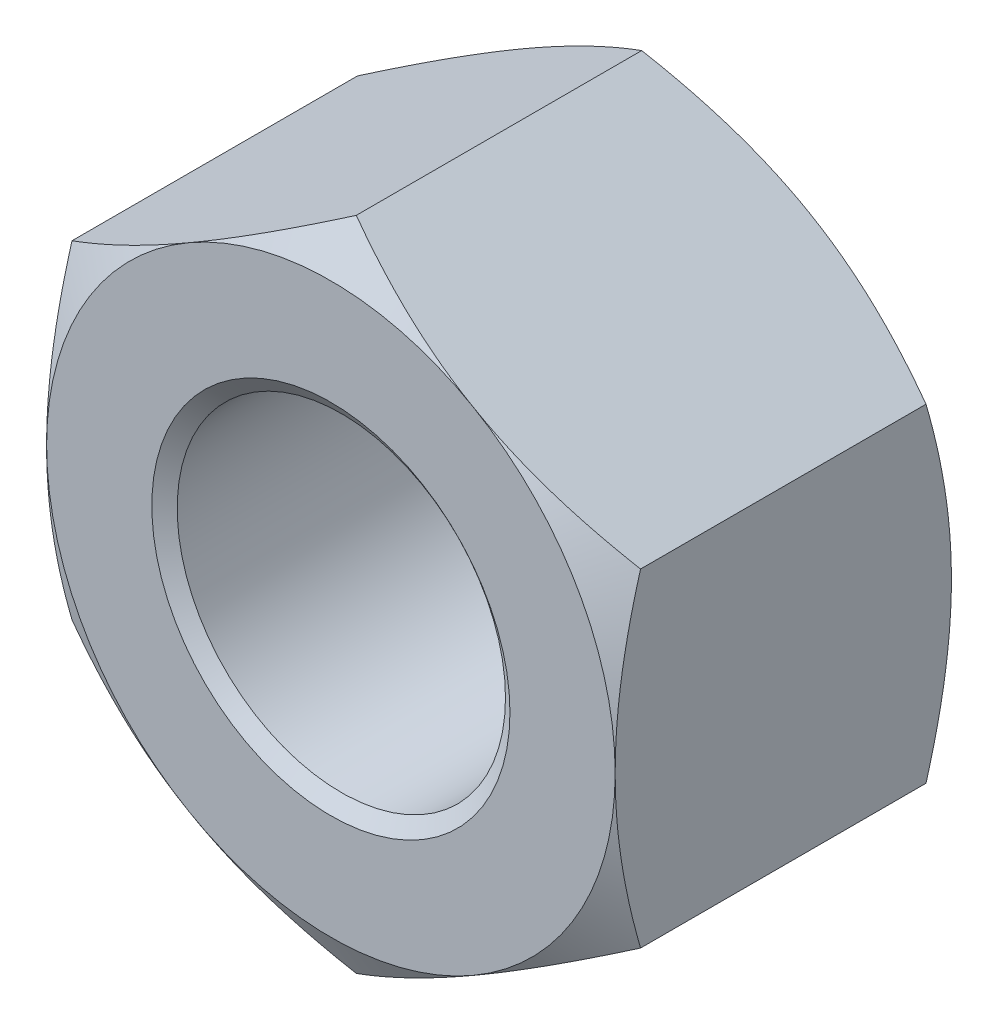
ISO-10303-21;
HEADER;
FILE_DESCRIPTION(('STEP AP214'),'2;1');
FILE_NAME('part.step','',(''),(''),'','','');
FILE_SCHEMA(('AUTOMOTIVE_DESIGN { 1 0 10303 214 1 1 1 1 }'));
ENDSEC;
DATA;
#1=APPLICATION_CONTEXT('core data for automotive mechanical design processes');
#2=APPLICATION_PROTOCOL_DEFINITION('international standard','automotive_design',2000,#1);
#3=PRODUCT_CONTEXT('',#1,'mechanical');
#4=PRODUCT('Part','Part','',(#3));
#5=PRODUCT_RELATED_PRODUCT_CATEGORY('part','',(#4));
#6=PRODUCT_DEFINITION_FORMATION('','',#4);
#7=PRODUCT_DEFINITION_CONTEXT('part definition',#1,'design');
#8=PRODUCT_DEFINITION('design','',#6,#7);
#9=PRODUCT_DEFINITION_SHAPE('','',#8);
#10=(LENGTH_UNIT() NAMED_UNIT(*) SI_UNIT(.MILLI.,.METRE.));
#11=(NAMED_UNIT(*) PLANE_ANGLE_UNIT() SI_UNIT($,.RADIAN.));
#12=(NAMED_UNIT(*) SI_UNIT($,.STERADIAN.) SOLID_ANGLE_UNIT());
#13=UNCERTAINTY_MEASURE_WITH_UNIT(LENGTH_MEASURE(1.E-05),#10,'distance_accuracy_value','');
#14=(GEOMETRIC_REPRESENTATION_CONTEXT(3) GLOBAL_UNCERTAINTY_ASSIGNED_CONTEXT((#13)) GLOBAL_UNIT_ASSIGNED_CONTEXT((#10,
#11,#12)) REPRESENTATION_CONTEXT('',''));
#15=CARTESIAN_POINT('',(0.,0.,0.));
#16=DIRECTION('',(0.,0.,1.));
#17=DIRECTION('',(1.,0.,0.));
#18=AXIS2_PLACEMENT_3D('',#15,#16,#17);
#19=CARTESIAN_POINT('',(0.,0.,-22.5298));
#20=DIRECTION('',(0.,0.,1.));
#21=DIRECTION('',(1.,0.,0.));
#22=AXIS2_PLACEMENT_3D('',#19,#20,#21);
#23=CYLINDRICAL_SURFACE('',#22,11.);
#24=CARTESIAN_POINT('',(0.,0.,-0.700207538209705));
#25=DIRECTION('',(0.,0.,1.));
#26=DIRECTION('',(1.,0.,0.));
#27=AXIS2_PLACEMENT_3D('',#24,#25,#26);
#28=CIRCLE('',#27,11.);
#29=CARTESIAN_POINT('',(11.,0.,-0.700207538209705));
#30=VERTEX_POINT('',#29);
#31=EDGE_CURVE('E155',#30,#30,#28,.F.);
#32=ORIENTED_EDGE('',*,*,#31,.F.);
#33=EDGE_LOOP('',(#32));
#34=FACE_BOUND('',#33,.T.);
#35=CARTESIAN_POINT('',(0.,0.,-21.8041924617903));
#36=DIRECTION('',(0.,0.,-1.));
#37=DIRECTION('',(-1.,0.,0.));
#38=AXIS2_PLACEMENT_3D('',#35,#36,#37);
#39=CIRCLE('',#38,11.);
#40=CARTESIAN_POINT('',(-11.,0.,-21.8041924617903));
#41=VERTEX_POINT('',#40);
#42=EDGE_CURVE('E46',#41,#41,#39,.F.);
#43=ORIENTED_EDGE('',*,*,#42,.F.);
#44=EDGE_LOOP('',(#43));
#45=FACE_BOUND('',#44,.T.);
#46=ADVANCED_FACE('F41',(#34,#45),#23,.F.);
#47=CARTESIAN_POINT('',(0.,21.9970452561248,-22.5298));
#48=DIRECTION('',(-0.500000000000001,0.866025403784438,0.));
#49=DIRECTION('',(-0.866025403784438,-0.500000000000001,0.));
#50=AXIS2_PLACEMENT_3D('',#47,#48,#49);
#51=PLANE('',#50);
#52=DIRECTION('',(0.,0.,1.));
#53=VECTOR('',#52,1.);
#54=CARTESIAN_POINT('',(-19.05,10.9985226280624,-22.5298));
#55=LINE('',#54,#53);
#56=CARTESIAN_POINT('',(-19.05,10.9985226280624,-20.8283226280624));
#57=VERTEX_POINT('',#56);
#58=CARTESIAN_POINT('',(-19.05,10.9985226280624,-1.70147737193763));
#59=VERTEX_POINT('',#58);
#60=EDGE_CURVE('E274',#57,#59,#55,.T.);
#61=ORIENTED_EDGE('',*,*,#60,.T.);
#62=CARTESIAN_POINT('',(-19.0502,10.9984071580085,-1.70154403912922));
#63=CARTESIAN_POINT('',(-18.6314889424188,11.2401500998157,-1.56198341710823));
#64=CARTESIAN_POINT('',(-18.2111446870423,11.4828359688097,-1.42875584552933));
#65=CARTESIAN_POINT('',(-17.3670855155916,11.9701537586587,-1.17672716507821));
#66=CARTESIAN_POINT('',(-16.9433695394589,12.2147862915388,-1.05793080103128));
#67=CARTESIAN_POINT('',(-16.0917480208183,12.7064702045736,-0.836361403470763));
#68=CARTESIAN_POINT('',(-15.6638350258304,12.9535258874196,-0.733626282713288));
#69=CARTESIAN_POINT('',(-14.8050356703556,13.4493539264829,-0.546385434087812));
#70=CARTESIAN_POINT('',(-14.374149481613,13.6981261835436,-0.461878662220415));
#71=CARTESIAN_POINT('',(-13.5204444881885,14.1910129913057,-0.314688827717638));
#72=CARTESIAN_POINT('',(-13.0976890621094,14.4350909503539,-0.2515185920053));
#73=CARTESIAN_POINT('',(-12.250241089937,14.9243652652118,-0.145596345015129));
#74=CARTESIAN_POINT('',(-11.8255485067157,15.1695616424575,-0.102844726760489));
#75=CARTESIAN_POINT('',(-10.9754499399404,15.6603662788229,-0.0388391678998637));
#76=CARTESIAN_POINT('',(-10.5500454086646,15.9059736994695,-0.0175596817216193));
#77=CARTESIAN_POINT('',(-9.6988436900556,16.397415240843,0.00304398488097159));
#78=CARTESIAN_POINT('',(-9.27304651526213,16.6432493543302,0.00236884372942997));
#79=CARTESIAN_POINT('',(-8.47700964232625,17.1028414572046,-0.0194033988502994));
#80=CARTESIAN_POINT('',(-8.10671322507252,17.316632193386,-0.0378455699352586));
#81=CARTESIAN_POINT('',(-7.36700369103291,17.7437036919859,-0.0909844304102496));
#82=CARTESIAN_POINT('',(-6.99759056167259,17.9569844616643,-0.125680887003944));
#83=CARTESIAN_POINT('',(-6.25978756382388,18.3829552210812,-0.210726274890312));
#84=CARTESIAN_POINT('',(-5.89139892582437,18.5956445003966,-0.261089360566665));
#85=CARTESIAN_POINT('',(-5.15637533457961,19.0200105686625,-0.376579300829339));
#86=CARTESIAN_POINT('',(-4.78974037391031,19.2316873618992,-0.441706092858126));
#87=CARTESIAN_POINT('',(-3.6767727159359,19.8742595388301,-0.660888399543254));
#88=CARTESIAN_POINT('',(-2.93366305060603,20.3032941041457,-0.836799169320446));
#89=CARTESIAN_POINT('',(-1.45852420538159,21.1549659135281,-1.23604434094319));
#90=CARTESIAN_POINT('',(-0.726476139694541,21.5776140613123,-1.45928498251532));
#91=CARTESIAN_POINT('',(0.000199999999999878,21.9971607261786,-1.70154403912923));
#92=B_SPLINE_CURVE_WITH_KNOTS('',3,(#62,#63,#64,#65,#66,#67,#68,#69,#70,#71,#72,#73,#74,#75,#76,
#77,#78,#79,#80,#81,#82,#83,#84,#85,#86,#87,#88,#89,#90,#91),.UNSPECIFIED.,.F.,.F.,(4,2,2,2,2,2,
2,2,2,2,2,2,2,2,4),(0.,1.50971559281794,3.01992622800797,4.53364959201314,6.04728623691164,
7.52356313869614,8.99986845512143,10.4744153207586,11.9489166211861,13.2325441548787,
14.5161533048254,15.8009255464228,17.085692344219,19.7118183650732,22.3327898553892),.UNSPECIFIED.);
#93=CARTESIAN_POINT('',(-9.52500000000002,16.4977839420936,0.));
#94=VERTEX_POINT('',#93);
#95=EDGE_CURVE('E68',#59,#94,#92,.T.);
#96=ORIENTED_EDGE('',*,*,#95,.T.);
#97=CARTESIAN_POINT('',(0.,21.9970452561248,-1.70147737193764));
#98=VERTEX_POINT('',#97);
#99=EDGE_CURVE('E147',#94,#98,#92,.T.);
#100=ORIENTED_EDGE('',*,*,#99,.T.);
#101=DIRECTION('',(0.,0.,1.));
#102=VECTOR('',#101,1.);
#103=CARTESIAN_POINT('',(0.,21.9970452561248,-22.5298));
#104=LINE('',#103,#102);
#105=CARTESIAN_POINT('',(0.,21.9970452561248,-20.8283226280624));
#106=VERTEX_POINT('',#105);
#107=EDGE_CURVE('E161',#106,#98,#104,.T.);
#108=ORIENTED_EDGE('',*,*,#107,.F.);
#109=CARTESIAN_POINT('',(-19.0502,10.9984071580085,-20.8282559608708));
#110=CARTESIAN_POINT('',(-18.6314889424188,11.2401500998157,-20.9678165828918));
#111=CARTESIAN_POINT('',(-18.2111446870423,11.4828359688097,-21.1010441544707));
#112=CARTESIAN_POINT('',(-17.3670855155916,11.9701537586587,-21.3530728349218));
#113=CARTESIAN_POINT('',(-16.9433695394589,12.2147862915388,-21.4718691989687));
#114=CARTESIAN_POINT('',(-16.0917480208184,12.7064702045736,-21.6934385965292));
#115=CARTESIAN_POINT('',(-15.6638350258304,12.9535258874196,-21.7961737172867));
#116=CARTESIAN_POINT('',(-14.8050356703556,13.4493539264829,-21.9834145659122));
#117=CARTESIAN_POINT('',(-14.374149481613,13.6981261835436,-22.0679213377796));
#118=CARTESIAN_POINT('',(-13.5204444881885,14.1910129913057,-22.2151111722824));
#119=CARTESIAN_POINT('',(-13.0976890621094,14.4350909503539,-22.2782814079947));
#120=CARTESIAN_POINT('',(-12.250241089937,14.9243652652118,-22.3842036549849));
#121=CARTESIAN_POINT('',(-11.8255485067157,15.1695616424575,-22.4269552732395));
#122=CARTESIAN_POINT('',(-10.9754499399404,15.6603662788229,-22.4909608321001));
#123=CARTESIAN_POINT('',(-10.5500454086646,15.9059736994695,-22.5122403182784));
#124=CARTESIAN_POINT('',(-9.6988436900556,16.397415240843,-22.532843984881));
#125=CARTESIAN_POINT('',(-9.27304651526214,16.6432493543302,-22.5321688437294));
#126=CARTESIAN_POINT('',(-8.47700964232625,17.1028414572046,-22.5103966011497));
#127=CARTESIAN_POINT('',(-8.10671322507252,17.316632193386,-22.4919544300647));
#128=CARTESIAN_POINT('',(-7.3670036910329,17.7437036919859,-22.4388155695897));
#129=CARTESIAN_POINT('',(-6.99759056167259,17.9569844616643,-22.4041191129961));
#130=CARTESIAN_POINT('',(-6.25978756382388,18.3829552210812,-22.3190737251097));
#131=CARTESIAN_POINT('',(-5.89139892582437,18.5956445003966,-22.2687106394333));
#132=CARTESIAN_POINT('',(-5.15637533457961,19.0200105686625,-22.1532206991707));
#133=CARTESIAN_POINT('',(-4.78974037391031,19.2316873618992,-22.0880939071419));
#134=CARTESIAN_POINT('',(-3.67677271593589,19.8742595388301,-21.8689116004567));
#135=CARTESIAN_POINT('',(-2.93366305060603,20.3032941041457,-21.6930008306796));
#136=CARTESIAN_POINT('',(-1.45852420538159,21.1549659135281,-21.2937556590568));
#137=CARTESIAN_POINT('',(-0.72647613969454,21.5776140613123,-21.0705150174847));
#138=CARTESIAN_POINT('',(0.000199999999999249,21.9971607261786,-20.8282559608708));
#139=B_SPLINE_CURVE_WITH_KNOTS('',3,(#109,#110,#111,#112,#113,#114,#115,#116,#117,#118,#119,
#120,#121,#122,#123,#124,#125,#126,#127,#128,#129,#130,#131,#132,#133,#134,#135,#136,#137,#138),
.UNSPECIFIED.,.F.,.F.,(4,2,2,2,2,2,2,2,2,2,2,2,2,2,4),(0.,1.50971559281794,3.01992622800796,
4.53364959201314,6.04728623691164,7.52356313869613,8.99986845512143,10.4744153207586,
11.9489166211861,13.2325441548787,14.5161533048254,15.8009255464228,17.085692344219,
19.7118183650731,22.3327898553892),.UNSPECIFIED.);
#140=CARTESIAN_POINT('',(-9.52500000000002,16.4977839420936,-22.5298));
#141=VERTEX_POINT('',#140);
#142=EDGE_CURVE('E253',#141,#106,#139,.T.);
#143=ORIENTED_EDGE('',*,*,#142,.F.);
#144=EDGE_CURVE('E239',#57,#141,#139,.T.);
#145=ORIENTED_EDGE('',*,*,#144,.F.);
#146=EDGE_LOOP('',(#61,#96,#100,#108,#143,#145));
#147=FACE_BOUND('',#146,.T.);
#148=ADVANCED_FACE('F43',(#147),#51,.T.);
#149=CARTESIAN_POINT('',(19.05,10.9985226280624,-22.5298));
#150=DIRECTION('',(0.500000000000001,0.866025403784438,0.));
#151=DIRECTION('',(-0.866025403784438,0.500000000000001,0.));
#152=AXIS2_PLACEMENT_3D('',#149,#150,#151);
#153=PLANE('',#152);
#154=ORIENTED_EDGE('',*,*,#107,.T.);
#155=CARTESIAN_POINT('',(-0.000200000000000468,21.9971607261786,-1.70154403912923));
#156=CARTESIAN_POINT('',(0.418511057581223,21.7554177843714,-1.56198341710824));
#157=CARTESIAN_POINT('',(0.83885531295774,21.5127319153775,-1.42875584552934));
#158=CARTESIAN_POINT('',(1.68291448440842,21.0254141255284,-1.17672716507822));
#159=CARTESIAN_POINT('',(2.10663046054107,20.7807815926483,-1.05793080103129));
#160=CARTESIAN_POINT('',(2.95825197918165,20.2890976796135,-0.836361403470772));
#161=CARTESIAN_POINT('',(3.38616497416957,20.0420419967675,-0.733626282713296));
#162=CARTESIAN_POINT('',(4.24496432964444,19.5462139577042,-0.546385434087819));
#163=CARTESIAN_POINT('',(4.67585051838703,19.2974417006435,-0.461878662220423));
#164=CARTESIAN_POINT('',(5.52955551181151,18.8045548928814,-0.314688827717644));
#165=CARTESIAN_POINT('',(5.95231093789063,18.5604769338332,-0.251518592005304));
#166=CARTESIAN_POINT('',(6.79975891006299,18.0712026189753,-0.145596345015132));
#167=CARTESIAN_POINT('',(7.22445149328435,17.8260062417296,-0.102844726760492));
#168=CARTESIAN_POINT('',(8.07455006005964,17.3352016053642,-0.0388391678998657));
#169=CARTESIAN_POINT('',(8.49995459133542,17.0895941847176,-0.0175596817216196));
#170=CARTESIAN_POINT('',(9.35115630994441,16.5981526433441,0.00304398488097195));
#171=CARTESIAN_POINT('',(9.77695348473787,16.3523185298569,0.00236884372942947));
#172=CARTESIAN_POINT('',(10.5729903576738,15.8927264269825,-0.019403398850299));
#173=CARTESIAN_POINT('',(10.9432867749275,15.6789356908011,-0.0378455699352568));
#174=CARTESIAN_POINT('',(11.6829963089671,15.2518641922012,-0.0909844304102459));
#175=CARTESIAN_POINT('',(12.0524094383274,15.0385834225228,-0.12568088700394));
#176=CARTESIAN_POINT('',(12.7902124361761,14.612612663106,-0.210726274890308));
#177=CARTESIAN_POINT('',(13.1586010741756,14.3999233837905,-0.261089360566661));
#178=CARTESIAN_POINT('',(13.8936246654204,13.9755573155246,-0.376579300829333));
#179=CARTESIAN_POINT('',(14.2602596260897,13.7638805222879,-0.441706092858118));
#180=CARTESIAN_POINT('',(15.3732272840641,13.121308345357,-0.660888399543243));
#181=CARTESIAN_POINT('',(16.116336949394,12.6922737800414,-0.836799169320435));
#182=CARTESIAN_POINT('',(17.5914757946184,11.840601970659,-1.23604434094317));
#183=CARTESIAN_POINT('',(18.3235238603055,11.4179538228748,-1.45928498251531));
#184=CARTESIAN_POINT('',(19.0502,10.9984071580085,-1.70154403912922));
#185=B_SPLINE_CURVE_WITH_KNOTS('',3,(#155,#156,#157,#158,#159,#160,#161,#162,#163,#164,#165,
#166,#167,#168,#169,#170,#171,#172,#173,#174,#175,#176,#177,#178,#179,#180,#181,#182,#183,#184),
.UNSPECIFIED.,.F.,.F.,(4,2,2,2,2,2,2,2,2,2,2,2,2,2,4),(0.,1.50971559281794,3.01992622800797,
4.53364959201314,6.04728623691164,7.52356313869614,8.99986845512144,10.4744153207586,
11.9489166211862,13.2325441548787,14.5161533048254,15.8009255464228,17.085692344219,
19.7118183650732,22.3327898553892),.UNSPECIFIED.);
#186=CARTESIAN_POINT('',(9.52500000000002,16.4977839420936,0.));
#187=VERTEX_POINT('',#186);
#188=EDGE_CURVE('E142',#98,#187,#185,.T.);
#189=ORIENTED_EDGE('',*,*,#188,.T.);
#190=CARTESIAN_POINT('',(19.05,10.9985226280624,-1.70147737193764));
#191=VERTEX_POINT('',#190);
#192=EDGE_CURVE('E133',#187,#191,#185,.T.);
#193=ORIENTED_EDGE('',*,*,#192,.T.);
#194=DIRECTION('',(0.,0.,1.));
#195=VECTOR('',#194,1.);
#196=CARTESIAN_POINT('',(19.05,10.9985226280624,-22.5298));
#197=LINE('',#196,#195);
#198=CARTESIAN_POINT('',(19.05,10.9985226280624,-20.8283226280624));
#199=VERTEX_POINT('',#198);
#200=EDGE_CURVE('E263',#199,#191,#197,.T.);
#201=ORIENTED_EDGE('',*,*,#200,.F.);
#202=CARTESIAN_POINT('',(-0.000200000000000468,21.9971607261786,-20.8282559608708));
#203=CARTESIAN_POINT('',(0.418511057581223,21.7554177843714,-20.9678165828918));
#204=CARTESIAN_POINT('',(0.83885531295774,21.5127319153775,-21.1010441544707));
#205=CARTESIAN_POINT('',(1.68291448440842,21.0254141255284,-21.3530728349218));
#206=CARTESIAN_POINT('',(2.10663046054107,20.7807815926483,-21.4718691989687));
#207=CARTESIAN_POINT('',(2.95825197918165,20.2890976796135,-21.6934385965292));
#208=CARTESIAN_POINT('',(3.38616497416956,20.0420419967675,-21.7961737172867));
#209=CARTESIAN_POINT('',(4.24496432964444,19.5462139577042,-21.9834145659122));
#210=CARTESIAN_POINT('',(4.67585051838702,19.2974417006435,-22.0679213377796));
#211=CARTESIAN_POINT('',(5.52955551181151,18.8045548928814,-22.2151111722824));
#212=CARTESIAN_POINT('',(5.95231093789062,18.5604769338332,-22.2782814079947));
#213=CARTESIAN_POINT('',(6.79975891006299,18.0712026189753,-22.3842036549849));
#214=CARTESIAN_POINT('',(7.22445149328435,17.8260062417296,-22.4269552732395));
#215=CARTESIAN_POINT('',(8.07455006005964,17.3352016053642,-22.4909608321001));
#216=CARTESIAN_POINT('',(8.49995459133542,17.0895941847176,-22.5122403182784));
#217=CARTESIAN_POINT('',(9.3511563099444,16.5981526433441,-22.532843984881));
#218=CARTESIAN_POINT('',(9.77695348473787,16.3523185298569,-22.5321688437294));
#219=CARTESIAN_POINT('',(10.5729903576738,15.8927264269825,-22.5103966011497));
#220=CARTESIAN_POINT('',(10.9432867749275,15.6789356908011,-22.4919544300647));
#221=CARTESIAN_POINT('',(11.6829963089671,15.2518641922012,-22.4388155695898));
#222=CARTESIAN_POINT('',(12.0524094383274,15.0385834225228,-22.4041191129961));
#223=CARTESIAN_POINT('',(12.7902124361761,14.612612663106,-22.3190737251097));
#224=CARTESIAN_POINT('',(13.1586010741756,14.3999233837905,-22.2687106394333));
#225=CARTESIAN_POINT('',(13.8936246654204,13.9755573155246,-22.1532206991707));
#226=CARTESIAN_POINT('',(14.2602596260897,13.7638805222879,-22.0880939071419));
#227=CARTESIAN_POINT('',(15.3732272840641,13.121308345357,-21.8689116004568));
#228=CARTESIAN_POINT('',(16.116336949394,12.6922737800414,-21.6930008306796));
#229=CARTESIAN_POINT('',(17.5914757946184,11.840601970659,-21.2937556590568));
#230=CARTESIAN_POINT('',(18.3235238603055,11.4179538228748,-21.0705150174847));
#231=CARTESIAN_POINT('',(19.0502,10.9984071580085,-20.8282559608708));
#232=B_SPLINE_CURVE_WITH_KNOTS('',3,(#202,#203,#204,#205,#206,#207,#208,#209,#210,#211,#212,
#213,#214,#215,#216,#217,#218,#219,#220,#221,#222,#223,#224,#225,#226,#227,#228,#229,#230,#231),
.UNSPECIFIED.,.F.,.F.,(4,2,2,2,2,2,2,2,2,2,2,2,2,2,4),(0.,1.50971559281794,3.01992622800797,
4.53364959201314,6.04728623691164,7.52356313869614,8.99986845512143,10.4744153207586,
11.9489166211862,13.2325441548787,14.5161533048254,15.8009255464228,17.085692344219,
19.7118183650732,22.3327898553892),.UNSPECIFIED.);
#233=CARTESIAN_POINT('',(9.52500000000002,16.4977839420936,-22.5298));
#234=VERTEX_POINT('',#233);
#235=EDGE_CURVE('E254',#234,#199,#232,.T.);
#236=ORIENTED_EDGE('',*,*,#235,.F.);
#237=EDGE_CURVE('E260',#106,#234,#232,.T.);
#238=ORIENTED_EDGE('',*,*,#237,.F.);
#239=EDGE_LOOP('',(#154,#189,#193,#201,#236,#238));
#240=FACE_BOUND('',#239,.T.);
#241=ADVANCED_FACE('F158',(#240),#153,.T.);
#242=CARTESIAN_POINT('',(19.05,10.9985226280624,-22.5298));
#243=DIRECTION('',(-1.,0.,0.));
#244=DIRECTION('',(0.,0.,1.));
#245=AXIS2_PLACEMENT_3D('',#242,#243,#244);
#246=PLANE('',#245);
#247=CARTESIAN_POINT('',(19.05,-29.169702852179,-9.11593373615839));
#248=CARTESIAN_POINT('',(19.05,-28.7515170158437,-8.91378890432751));
#249=CARTESIAN_POINT('',(19.05,-28.3328257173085,-8.71269026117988));
#250=CARTESIAN_POINT('',(19.05,-27.494325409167,-8.31282549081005));
#251=CARTESIAN_POINT('',(19.05,-27.0745163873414,-8.11405938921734));
#252=CARTESIAN_POINT('',(19.05,-25.813129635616,-7.52156252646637));
#253=CARTESIAN_POINT('',(19.05,-24.9697281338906,-7.13169909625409));
#254=CARTESIAN_POINT('',(19.05,-23.2722707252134,-6.36257122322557));
#255=CARTESIAN_POINT('',(19.05,-22.4181814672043,-5.98338020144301));
#256=CARTESIAN_POINT('',(19.05,-20.7029839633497,-5.24127883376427));
#257=CARTESIAN_POINT('',(19.05,-19.8418760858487,-4.87836763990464));
#258=CARTESIAN_POINT('',(19.05,-18.1005821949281,-4.1688569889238));
#259=CARTESIAN_POINT('',(19.05,-17.2202917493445,-3.82251248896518));
#260=CARTESIAN_POINT('',(19.05,-15.4493217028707,-3.15694792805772));
#261=CARTESIAN_POINT('',(19.05,-14.5586409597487,-2.83773088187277));
#262=CARTESIAN_POINT('',(19.05,-12.7673320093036,-2.2350028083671));
#263=CARTESIAN_POINT('',(19.05,-11.8667295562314,-1.95141586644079));
#264=CARTESIAN_POINT('',(19.05,-10.0526343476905,-1.42914392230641));
#265=CARTESIAN_POINT('',(19.05,-9.13914576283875,-1.19044473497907));
#266=CARTESIAN_POINT('',(19.05,-7.7590746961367,-0.874799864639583));
#267=CARTESIAN_POINT('',(19.05,-7.29731333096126,-0.776636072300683));
#268=CARTESIAN_POINT('',(19.05,-6.37071732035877,-0.595993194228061));
#269=CARTESIAN_POINT('',(19.05,-5.90588274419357,-0.513513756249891));
#270=CARTESIAN_POINT('',(19.05,-4.97345228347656,-0.36570182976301));
#271=CARTESIAN_POINT('',(19.05,-4.50585623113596,-0.30037039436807));
#272=CARTESIAN_POINT('',(19.05,-3.56843861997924,-0.188166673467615));
#273=CARTESIAN_POINT('',(19.05,-3.09861705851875,-0.141294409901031));
#274=CARTESIAN_POINT('',(19.05,-2.16041609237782,-0.0672708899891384));
#275=CARTESIAN_POINT('',(19.05,-1.69204648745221,-0.039996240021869));
#276=CARTESIAN_POINT('',(19.05,-0.754574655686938,-0.00531133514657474));
#277=CARTESIAN_POINT('',(19.05,-0.285472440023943,0.00209921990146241));
#278=CARTESIAN_POINT('',(19.05,0.6524929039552,-0.00311981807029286));
#279=CARTESIAN_POINT('',(19.05,1.12135606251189,-0.015743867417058));
#280=CARTESIAN_POINT('',(19.05,2.05813737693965,-0.0607182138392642));
#281=CARTESIAN_POINT('',(19.05,2.52605549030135,-0.0930693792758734));
#282=CARTESIAN_POINT('',(19.05,3.65980250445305,-0.194680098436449));
#283=CARTESIAN_POINT('',(19.05,4.32476458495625,-0.273803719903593));
#284=CARTESIAN_POINT('',(19.05,5.64947952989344,-0.467485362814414));
#285=CARTESIAN_POINT('',(19.05,6.30923160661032,-0.582048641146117));
#286=CARTESIAN_POINT('',(19.05,8.2818238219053,-0.973151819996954));
#287=CARTESIAN_POINT('',(19.05,9.58542312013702,-1.29684470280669));
#288=CARTESIAN_POINT('',(19.05,11.5353898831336,-1.85499845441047));
#289=CARTESIAN_POINT('',(19.05,12.191945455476,-2.05588340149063));
#290=CARTESIAN_POINT('',(19.05,13.498713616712,-2.47768236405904));
#291=CARTESIAN_POINT('',(19.05,14.1489256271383,-2.69859818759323));
#292=CARTESIAN_POINT('',(19.05,15.4397656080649,-3.15575174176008));
#293=CARTESIAN_POINT('',(19.05,16.0804269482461,-3.39189604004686));
#294=CARTESIAN_POINT('',(19.05,17.0373840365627,-3.75633654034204));
#295=CARTESIAN_POINT('',(19.05,17.3556458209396,-3.87949985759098));
#296=CARTESIAN_POINT('',(19.05,17.9909330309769,-4.12895791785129));
#297=CARTESIAN_POINT('',(19.05,18.3079584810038,-4.25525259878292));
#298=CARTESIAN_POINT('',(19.05,18.6244086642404,-4.38297164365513));
#299=B_SPLINE_CURVE_WITH_KNOTS('',3,(#247,#248,#249,#250,#251,#252,#253,#254,#255,#256,#257,
#258,#259,#260,#261,#262,#263,#264,#265,#266,#267,#268,#269,#270,#271,#272,#273,#274,#275,#276,
#277,#278,#279,#280,#281,#282,#283,#284,#285,#286,#287,#288,#289,#290,#291,#292,#293,#294,#295,
#296,#297,#298),.UNSPECIFIED.,.F.,.F.,(4,2,2,2,2,2,2,2,2,2,2,2,2,2,2,2,2,2,2,2,2,2,2,2,2,4),(0.,
1.39343811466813,2.78689152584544,5.57425145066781,8.37756231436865,11.1807269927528,
14.0183059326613,16.856199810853,19.6879407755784,22.5187853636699,23.934802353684,
25.3507875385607,26.766859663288,28.1829334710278,29.5900111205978,30.9970675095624,
32.4037346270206,33.8104636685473,35.8182820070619,37.8263983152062,41.8503661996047,
43.9100054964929,45.9698308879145,48.0180400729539,49.0418117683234,50.0655631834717),.UNSPECIFIED.);
#300=CARTESIAN_POINT('',(19.05,-10.9985226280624,-1.70147737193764));
#301=VERTEX_POINT('',#300);
#302=CARTESIAN_POINT('',(19.05,0.,0.));
#303=VERTEX_POINT('',#302);
#304=EDGE_CURVE('E217',#301,#303,#299,.T.);
#305=ORIENTED_EDGE('',*,*,#304,.F.);
#306=DIRECTION('',(0.,0.,1.));
#307=VECTOR('',#306,1.);
#308=CARTESIAN_POINT('',(19.05,-10.9985226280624,-22.5298));
#309=LINE('',#308,#307);
#310=CARTESIAN_POINT('',(19.05,-10.9985226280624,-20.8283226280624));
#311=VERTEX_POINT('',#310);
#312=EDGE_CURVE('E265',#311,#301,#309,.T.);
#313=ORIENTED_EDGE('',*,*,#312,.F.);
#314=CARTESIAN_POINT('',(19.05,-29.169702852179,-13.4138662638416));
#315=CARTESIAN_POINT('',(19.05,-28.7515170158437,-13.6160110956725));
#316=CARTESIAN_POINT('',(19.05,-28.3328257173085,-13.8171097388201));
#317=CARTESIAN_POINT('',(19.05,-27.494325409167,-14.21697450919));
#318=CARTESIAN_POINT('',(19.05,-27.0745163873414,-14.4157406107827));
#319=CARTESIAN_POINT('',(19.05,-25.813129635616,-15.0082374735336));
#320=CARTESIAN_POINT('',(19.05,-24.9697281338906,-15.3981009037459));
#321=CARTESIAN_POINT('',(19.05,-23.2722707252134,-16.1672287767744));
#322=CARTESIAN_POINT('',(19.05,-22.4181814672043,-16.546419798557));
#323=CARTESIAN_POINT('',(19.05,-20.7029839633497,-17.2885211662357));
#324=CARTESIAN_POINT('',(19.05,-19.8418760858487,-17.6514323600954));
#325=CARTESIAN_POINT('',(19.05,-18.1005821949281,-18.3609430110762));
#326=CARTESIAN_POINT('',(19.05,-17.2202917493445,-18.7072875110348));
#327=CARTESIAN_POINT('',(19.05,-15.4493217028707,-19.3728520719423));
#328=CARTESIAN_POINT('',(19.05,-14.5586409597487,-19.6920691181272));
#329=CARTESIAN_POINT('',(19.05,-12.7673320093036,-20.2947971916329));
#330=CARTESIAN_POINT('',(19.05,-11.8667295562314,-20.5783841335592));
#331=CARTESIAN_POINT('',(19.05,-10.0526343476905,-21.1006560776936));
#332=CARTESIAN_POINT('',(19.05,-9.13914576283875,-21.3393552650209));
#333=CARTESIAN_POINT('',(19.05,-7.7590746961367,-21.6550001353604));
#334=CARTESIAN_POINT('',(19.05,-7.29731333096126,-21.7531639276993));
#335=CARTESIAN_POINT('',(19.05,-6.37071732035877,-21.9338068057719));
#336=CARTESIAN_POINT('',(19.05,-5.90588274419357,-22.0162862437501));
#337=CARTESIAN_POINT('',(19.05,-4.97345228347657,-22.164098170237));
#338=CARTESIAN_POINT('',(19.05,-4.50585623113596,-22.2294296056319));
#339=CARTESIAN_POINT('',(19.05,-3.56843861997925,-22.3416333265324));
#340=CARTESIAN_POINT('',(19.05,-3.09861705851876,-22.388505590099));
#341=CARTESIAN_POINT('',(19.05,-2.16041609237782,-22.4625291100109));
#342=CARTESIAN_POINT('',(19.05,-1.69204648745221,-22.4898037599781));
#343=CARTESIAN_POINT('',(19.05,-0.754574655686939,-22.5244886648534));
#344=CARTESIAN_POINT('',(19.05,-0.285472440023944,-22.5318992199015));
#345=CARTESIAN_POINT('',(19.05,0.652492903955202,-22.5266801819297));
#346=CARTESIAN_POINT('',(19.05,1.12135606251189,-22.5140561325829));
#347=CARTESIAN_POINT('',(19.05,2.05813737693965,-22.4690817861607));
#348=CARTESIAN_POINT('',(19.05,2.52605549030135,-22.4367306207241));
#349=CARTESIAN_POINT('',(19.05,3.65980250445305,-22.3351199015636));
#350=CARTESIAN_POINT('',(19.05,4.32476458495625,-22.2559962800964));
#351=CARTESIAN_POINT('',(19.05,5.64947952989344,-22.0623146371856));
#352=CARTESIAN_POINT('',(19.05,6.30923160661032,-21.9477513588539));
#353=CARTESIAN_POINT('',(19.05,8.2818238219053,-21.556648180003));
#354=CARTESIAN_POINT('',(19.05,9.58542312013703,-21.2329552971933));
#355=CARTESIAN_POINT('',(19.05,11.5353898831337,-20.6748015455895));
#356=CARTESIAN_POINT('',(19.05,12.191945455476,-20.4739165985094));
#357=CARTESIAN_POINT('',(19.05,13.498713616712,-20.052117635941));
#358=CARTESIAN_POINT('',(19.05,14.1489256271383,-19.8312018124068));
#359=CARTESIAN_POINT('',(19.05,15.4397656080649,-19.3740482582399));
#360=CARTESIAN_POINT('',(19.05,16.0804269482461,-19.1379039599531));
#361=CARTESIAN_POINT('',(19.05,17.0373840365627,-18.773463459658));
#362=CARTESIAN_POINT('',(19.05,17.3556458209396,-18.650300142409));
#363=CARTESIAN_POINT('',(19.05,17.9909330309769,-18.4008420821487));
#364=CARTESIAN_POINT('',(19.05,18.3079584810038,-18.2745474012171));
#365=CARTESIAN_POINT('',(19.05,18.6244086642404,-18.1468283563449));
#366=B_SPLINE_CURVE_WITH_KNOTS('',3,(#314,#315,#316,#317,#318,#319,#320,#321,#322,#323,#324,
#325,#326,#327,#328,#329,#330,#331,#332,#333,#334,#335,#336,#337,#338,#339,#340,#341,#342,#343,
#344,#345,#346,#347,#348,#349,#350,#351,#352,#353,#354,#355,#356,#357,#358,#359,#360,#361,#362,
#363,#364,#365),.UNSPECIFIED.,.F.,.F.,(4,2,2,2,2,2,2,2,2,2,2,2,2,2,2,2,2,2,2,2,2,2,2,2,2,4),(0.,
1.39343811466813,2.78689152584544,5.57425145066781,8.37756231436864,11.1807269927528,
14.0183059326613,16.856199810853,19.6879407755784,22.5187853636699,23.934802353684,
25.3507875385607,26.766859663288,28.1829334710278,29.5900111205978,30.9970675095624,
32.4037346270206,33.8104636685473,35.8182820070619,37.8263983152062,41.8503661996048,
43.910005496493,45.9698308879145,48.0180400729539,49.0418117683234,50.0655631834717),.UNSPECIFIED.);
#367=CARTESIAN_POINT('',(19.05,0.,-22.5298));
#368=VERTEX_POINT('',#367);
#369=EDGE_CURVE('E231',#311,#368,#366,.T.);
#370=ORIENTED_EDGE('',*,*,#369,.T.);
#371=EDGE_CURVE('E241',#368,#199,#366,.T.);
#372=ORIENTED_EDGE('',*,*,#371,.T.);
#373=ORIENTED_EDGE('',*,*,#200,.T.);
#374=EDGE_CURVE('E137',#303,#191,#299,.T.);
#375=ORIENTED_EDGE('',*,*,#374,.F.);
#376=EDGE_LOOP('',(#305,#313,#370,#372,#373,#375));
#377=FACE_BOUND('',#376,.T.);
#378=ADVANCED_FACE('F223',(#377),#246,.F.);
#379=CARTESIAN_POINT('',(0.,-21.9970452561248,-22.5298));
#380=DIRECTION('',(0.500000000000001,-0.866025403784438,0.));
#381=DIRECTION('',(0.866025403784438,0.500000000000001,0.));
#382=AXIS2_PLACEMENT_3D('',#379,#380,#381);
#383=PLANE('',#382);
#384=ORIENTED_EDGE('',*,*,#312,.T.);
#385=CARTESIAN_POINT('',(19.0502,-10.9984071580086,-1.70154403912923));
#386=CARTESIAN_POINT('',(18.6314889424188,-11.2401500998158,-1.56198341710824));
#387=CARTESIAN_POINT('',(18.2111446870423,-11.4828359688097,-1.42875584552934));
#388=CARTESIAN_POINT('',(17.3670855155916,-11.9701537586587,-1.17672716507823));
#389=CARTESIAN_POINT('',(16.9433695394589,-12.2147862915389,-1.05793080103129));
#390=CARTESIAN_POINT('',(16.0917480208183,-12.7064702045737,-0.836361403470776));
#391=CARTESIAN_POINT('',(15.6638350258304,-12.9535258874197,-0.733626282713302));
#392=CARTESIAN_POINT('',(14.8050356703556,-13.449353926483,-0.546385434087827));
#393=CARTESIAN_POINT('',(14.374149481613,-13.6981261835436,-0.461878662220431));
#394=CARTESIAN_POINT('',(13.5204444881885,-14.1910129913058,-0.314688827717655));
#395=CARTESIAN_POINT('',(13.0976890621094,-14.4350909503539,-0.251518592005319));
#396=CARTESIAN_POINT('',(12.250241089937,-14.9243652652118,-0.14559634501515));
#397=CARTESIAN_POINT('',(11.8255485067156,-15.1695616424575,-0.102844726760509));
#398=CARTESIAN_POINT('',(10.9754499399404,-15.660366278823,-0.0388391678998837));
#399=CARTESIAN_POINT('',(10.5500454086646,-15.9059736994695,-0.0175596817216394));
#400=CARTESIAN_POINT('',(9.69884369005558,-16.3974152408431,0.00304398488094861));
#401=CARTESIAN_POINT('',(9.27304651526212,-16.6432493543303,0.00236884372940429));
#402=CARTESIAN_POINT('',(8.47700964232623,-17.1028414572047,-0.0194033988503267));
#403=CARTESIAN_POINT('',(8.10671322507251,-17.3166321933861,-0.0378455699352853));
#404=CARTESIAN_POINT('',(7.36700369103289,-17.743703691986,-0.0909844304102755));
#405=CARTESIAN_POINT('',(6.99759056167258,-17.9569844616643,-0.12568088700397));
#406=CARTESIAN_POINT('',(6.25978756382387,-18.3829552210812,-0.21072627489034));
#407=CARTESIAN_POINT('',(5.89139892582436,-18.5956445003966,-0.261089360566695));
#408=CARTESIAN_POINT('',(5.15637533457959,-19.0200105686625,-0.37657930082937));
#409=CARTESIAN_POINT('',(4.78974037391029,-19.2316873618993,-0.441706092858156));
#410=CARTESIAN_POINT('',(3.67677271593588,-19.8742595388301,-0.660888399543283));
#411=CARTESIAN_POINT('',(2.93366305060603,-20.3032941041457,-0.836799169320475));
#412=CARTESIAN_POINT('',(1.45852420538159,-21.1549659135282,-1.23604434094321));
#413=CARTESIAN_POINT('',(0.726476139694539,-21.5776140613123,-1.45928498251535));
#414=CARTESIAN_POINT('',(-0.000200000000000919,-21.9971607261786,-1.70154403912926));
#415=B_SPLINE_CURVE_WITH_KNOTS('',3,(#385,#386,#387,#388,#389,#390,#391,#392,#393,#394,#395,
#396,#397,#398,#399,#400,#401,#402,#403,#404,#405,#406,#407,#408,#409,#410,#411,#412,#413,#414),
.UNSPECIFIED.,.F.,.F.,(4,2,2,2,2,2,2,2,2,2,2,2,2,2,4),(0.,1.50971559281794,3.01992622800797,
4.53364959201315,6.04728623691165,7.52356313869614,8.99986845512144,10.4744153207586,
11.9489166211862,13.2325441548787,14.5161533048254,15.8009255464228,17.085692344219,
19.7118183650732,22.3327898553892),.UNSPECIFIED.);
#416=CARTESIAN_POINT('',(9.52500000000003,-16.4977839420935,0.));
#417=VERTEX_POINT('',#416);
#418=EDGE_CURVE('E222',#301,#417,#415,.T.);
#419=ORIENTED_EDGE('',*,*,#418,.T.);
#420=CARTESIAN_POINT('',(0.,-21.9970452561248,-1.70147737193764));
#421=VERTEX_POINT('',#420);
#422=EDGE_CURVE('E211',#417,#421,#415,.T.);
#423=ORIENTED_EDGE('',*,*,#422,.T.);
#424=DIRECTION('',(0.,0.,1.));
#425=VECTOR('',#424,1.);
#426=CARTESIAN_POINT('',(0.,-21.9970452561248,-22.5298));
#427=LINE('',#426,#425);
#428=CARTESIAN_POINT('',(0.,-21.9970452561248,-20.8283226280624));
#429=VERTEX_POINT('',#428);
#430=EDGE_CURVE('E268',#429,#421,#427,.T.);
#431=ORIENTED_EDGE('',*,*,#430,.F.);
#432=CARTESIAN_POINT('',(19.0502,-10.9984071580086,-20.8282559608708));
#433=CARTESIAN_POINT('',(18.6314889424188,-11.2401500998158,-20.9678165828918));
#434=CARTESIAN_POINT('',(18.2111446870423,-11.4828359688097,-21.1010441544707));
#435=CARTESIAN_POINT('',(17.3670855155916,-11.9701537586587,-21.3530728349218));
#436=CARTESIAN_POINT('',(16.9433695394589,-12.2147862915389,-21.4718691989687));
#437=CARTESIAN_POINT('',(16.0917480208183,-12.7064702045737,-21.6934385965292));
#438=CARTESIAN_POINT('',(15.6638350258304,-12.9535258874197,-21.7961737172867));
#439=CARTESIAN_POINT('',(14.8050356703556,-13.449353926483,-21.9834145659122));
#440=CARTESIAN_POINT('',(14.374149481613,-13.6981261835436,-22.0679213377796));
#441=CARTESIAN_POINT('',(13.5204444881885,-14.1910129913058,-22.2151111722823));
#442=CARTESIAN_POINT('',(13.0976890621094,-14.4350909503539,-22.2782814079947));
#443=CARTESIAN_POINT('',(12.250241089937,-14.9243652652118,-22.3842036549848));
#444=CARTESIAN_POINT('',(11.8255485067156,-15.1695616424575,-22.4269552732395));
#445=CARTESIAN_POINT('',(10.9754499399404,-15.660366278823,-22.4909608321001));
#446=CARTESIAN_POINT('',(10.5500454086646,-15.9059736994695,-22.5122403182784));
#447=CARTESIAN_POINT('',(9.69884369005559,-16.3974152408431,-22.5328439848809));
#448=CARTESIAN_POINT('',(9.27304651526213,-16.6432493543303,-22.5321688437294));
#449=CARTESIAN_POINT('',(8.47700964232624,-17.1028414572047,-22.5103966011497));
#450=CARTESIAN_POINT('',(8.10671322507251,-17.3166321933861,-22.4919544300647));
#451=CARTESIAN_POINT('',(7.3670036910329,-17.743703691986,-22.4388155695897));
#452=CARTESIAN_POINT('',(6.99759056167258,-17.9569844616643,-22.404119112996));
#453=CARTESIAN_POINT('',(6.25978756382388,-18.3829552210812,-22.3190737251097));
#454=CARTESIAN_POINT('',(5.89139892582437,-18.5956445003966,-22.2687106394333));
#455=CARTESIAN_POINT('',(5.1563753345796,-19.0200105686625,-22.1532206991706));
#456=CARTESIAN_POINT('',(4.7897403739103,-19.2316873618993,-22.0880939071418));
#457=CARTESIAN_POINT('',(3.67677271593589,-19.8742595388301,-21.8689116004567));
#458=CARTESIAN_POINT('',(2.93366305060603,-20.3032941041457,-21.6930008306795));
#459=CARTESIAN_POINT('',(1.45852420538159,-21.1549659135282,-21.2937556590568));
#460=CARTESIAN_POINT('',(0.726476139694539,-21.5776140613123,-21.0705150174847));
#461=CARTESIAN_POINT('',(-0.000200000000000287,-21.9971607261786,-20.8282559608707));
#462=B_SPLINE_CURVE_WITH_KNOTS('',3,(#432,#433,#434,#435,#436,#437,#438,#439,#440,#441,#442,
#443,#444,#445,#446,#447,#448,#449,#450,#451,#452,#453,#454,#455,#456,#457,#458,#459,#460,#461),
.UNSPECIFIED.,.F.,.F.,(4,2,2,2,2,2,2,2,2,2,2,2,2,2,4),(0.,1.50971559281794,3.01992622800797,
4.53364959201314,6.04728623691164,7.52356313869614,8.99986845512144,10.4744153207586,
11.9489166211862,13.2325441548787,14.5161533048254,15.8009255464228,17.085692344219,
19.7118183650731,22.3327898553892),.UNSPECIFIED.);
#463=CARTESIAN_POINT('',(9.52500000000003,-16.4977839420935,-22.5298));
#464=VERTEX_POINT('',#463);
#465=EDGE_CURVE('E242',#464,#429,#462,.T.);
#466=ORIENTED_EDGE('',*,*,#465,.F.);
#467=EDGE_CURVE('E240',#311,#464,#462,.T.);
#468=ORIENTED_EDGE('',*,*,#467,.F.);
#469=EDGE_LOOP('',(#384,#419,#423,#431,#466,#468));
#470=FACE_BOUND('',#469,.T.);
#471=ADVANCED_FACE('F226',(#470),#383,.T.);
#472=CARTESIAN_POINT('',(-19.05,-10.9985226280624,-22.5298));
#473=DIRECTION('',(-0.500000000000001,-0.866025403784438,0.));
#474=DIRECTION('',(0.866025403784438,-0.500000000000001,0.));
#475=AXIS2_PLACEMENT_3D('',#472,#473,#474);
#476=PLANE('',#475);
#477=ORIENTED_EDGE('',*,*,#430,.T.);
#478=CARTESIAN_POINT('',(0.000199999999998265,-21.9971607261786,-1.70154403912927));
#479=CARTESIAN_POINT('',(-0.418511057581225,-21.7554177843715,-1.56198341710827));
#480=CARTESIAN_POINT('',(-0.838855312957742,-21.5127319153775,-1.42875584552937));
#481=CARTESIAN_POINT('',(-1.68291448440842,-21.0254141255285,-1.17672716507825));
#482=CARTESIAN_POINT('',(-2.10663046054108,-20.7807815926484,-1.05793080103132));
#483=CARTESIAN_POINT('',(-2.95825197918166,-20.2890976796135,-0.836361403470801));
#484=CARTESIAN_POINT('',(-3.38616497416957,-20.0420419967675,-0.733626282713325));
#485=CARTESIAN_POINT('',(-4.24496432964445,-19.5462139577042,-0.546385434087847));
#486=CARTESIAN_POINT('',(-4.67585051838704,-19.2974417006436,-0.461878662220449));
#487=CARTESIAN_POINT('',(-5.52955551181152,-18.8045548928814,-0.31468882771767));
#488=CARTESIAN_POINT('',(-5.95231093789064,-18.5604769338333,-0.251518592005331));
#489=CARTESIAN_POINT('',(-6.79975891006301,-18.0712026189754,-0.145596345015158));
#490=CARTESIAN_POINT('',(-7.22445149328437,-17.8260062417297,-0.102844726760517));
#491=CARTESIAN_POINT('',(-8.07455006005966,-17.3352016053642,-0.0388391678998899));
#492=CARTESIAN_POINT('',(-8.49995459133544,-17.0895941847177,-0.0175596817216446));
#493=CARTESIAN_POINT('',(-9.35115630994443,-16.5981526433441,0.00304398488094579));
#494=CARTESIAN_POINT('',(-9.7769534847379,-16.3523185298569,0.00236884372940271));
#495=CARTESIAN_POINT('',(-10.5729903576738,-15.8927264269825,-0.0194033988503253));
#496=CARTESIAN_POINT('',(-10.9432867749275,-15.6789356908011,-0.0378455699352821));
#497=CARTESIAN_POINT('',(-11.6829963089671,-15.2518641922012,-0.0909844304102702));
#498=CARTESIAN_POINT('',(-12.0524094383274,-15.0385834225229,-0.125680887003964));
#499=CARTESIAN_POINT('',(-12.7902124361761,-14.612612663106,-0.210726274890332));
#500=CARTESIAN_POINT('',(-13.1586010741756,-14.3999233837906,-0.261089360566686));
#501=CARTESIAN_POINT('',(-13.8936246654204,-13.9755573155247,-0.376579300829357));
#502=CARTESIAN_POINT('',(-14.2602596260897,-13.7638805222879,-0.441706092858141));
#503=CARTESIAN_POINT('',(-15.3732272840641,-13.1213083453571,-0.660888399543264));
#504=CARTESIAN_POINT('',(-16.116336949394,-12.6922737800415,-0.836799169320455));
#505=CARTESIAN_POINT('',(-17.5914757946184,-11.840601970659,-1.23604434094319));
#506=CARTESIAN_POINT('',(-18.3235238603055,-11.4179538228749,-1.45928498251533));
#507=CARTESIAN_POINT('',(-19.0502,-10.9984071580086,-1.70154403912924));
#508=B_SPLINE_CURVE_WITH_KNOTS('',3,(#478,#479,#480,#481,#482,#483,#484,#485,#486,#487,#488,
#489,#490,#491,#492,#493,#494,#495,#496,#497,#498,#499,#500,#501,#502,#503,#504,#505,#506,#507),
.UNSPECIFIED.,.F.,.F.,(4,2,2,2,2,2,2,2,2,2,2,2,2,2,4),(0.,1.50971559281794,3.01992622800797,
4.53364959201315,6.04728623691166,7.52356313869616,8.99986845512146,10.4744153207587,
11.9489166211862,13.2325441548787,14.5161533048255,15.8009255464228,17.085692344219,
19.7118183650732,22.3327898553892),.UNSPECIFIED.);
#509=CARTESIAN_POINT('',(-9.52500000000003,-16.4977839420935,0.));
#510=VERTEX_POINT('',#509);
#511=EDGE_CURVE('E363',#421,#510,#508,.T.);
#512=ORIENTED_EDGE('',*,*,#511,.T.);
#513=CARTESIAN_POINT('',(-19.05,-10.9985226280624,-1.70147737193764));
#514=VERTEX_POINT('',#513);
#515=EDGE_CURVE('E203',#510,#514,#508,.T.);
#516=ORIENTED_EDGE('',*,*,#515,.T.);
#517=DIRECTION('',(0.,0.,1.));
#518=VECTOR('',#517,1.);
#519=CARTESIAN_POINT('',(-19.05,-10.9985226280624,-22.5298));
#520=LINE('',#519,#518);
#521=CARTESIAN_POINT('',(-19.05,-10.9985226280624,-20.8283226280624));
#522=VERTEX_POINT('',#521);
#523=EDGE_CURVE('E271',#522,#514,#520,.T.);
#524=ORIENTED_EDGE('',*,*,#523,.F.);
#525=CARTESIAN_POINT('',(0.000199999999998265,-21.9971607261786,-20.8282559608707));
#526=CARTESIAN_POINT('',(-0.418511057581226,-21.7554177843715,-20.9678165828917));
#527=CARTESIAN_POINT('',(-0.838855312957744,-21.5127319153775,-21.1010441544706));
#528=CARTESIAN_POINT('',(-1.68291448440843,-21.0254141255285,-21.3530728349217));
#529=CARTESIAN_POINT('',(-2.10663046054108,-20.7807815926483,-21.4718691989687));
#530=CARTESIAN_POINT('',(-2.95825197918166,-20.2890976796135,-21.6934385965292));
#531=CARTESIAN_POINT('',(-3.38616497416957,-20.0420419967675,-21.7961737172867));
#532=CARTESIAN_POINT('',(-4.24496432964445,-19.5462139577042,-21.9834145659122));
#533=CARTESIAN_POINT('',(-4.67585051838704,-19.2974417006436,-22.0679213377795));
#534=CARTESIAN_POINT('',(-5.52955551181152,-18.8045548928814,-22.2151111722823));
#535=CARTESIAN_POINT('',(-5.95231093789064,-18.5604769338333,-22.2782814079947));
#536=CARTESIAN_POINT('',(-6.79975891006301,-18.0712026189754,-22.3842036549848));
#537=CARTESIAN_POINT('',(-7.22445149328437,-17.8260062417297,-22.4269552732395));
#538=CARTESIAN_POINT('',(-8.07455006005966,-17.3352016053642,-22.4909608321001));
#539=CARTESIAN_POINT('',(-8.49995459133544,-17.0895941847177,-22.5122403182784));
#540=CARTESIAN_POINT('',(-9.35115630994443,-16.5981526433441,-22.5328439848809));
#541=CARTESIAN_POINT('',(-9.7769534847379,-16.3523185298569,-22.5321688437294));
#542=CARTESIAN_POINT('',(-10.5729903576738,-15.8927264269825,-22.5103966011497));
#543=CARTESIAN_POINT('',(-10.9432867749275,-15.6789356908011,-22.4919544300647));
#544=CARTESIAN_POINT('',(-11.6829963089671,-15.2518641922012,-22.4388155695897));
#545=CARTESIAN_POINT('',(-12.0524094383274,-15.0385834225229,-22.404119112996));
#546=CARTESIAN_POINT('',(-12.7902124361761,-14.612612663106,-22.3190737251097));
#547=CARTESIAN_POINT('',(-13.1586010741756,-14.3999233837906,-22.2687106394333));
#548=CARTESIAN_POINT('',(-13.8936246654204,-13.9755573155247,-22.1532206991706));
#549=CARTESIAN_POINT('',(-14.2602596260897,-13.7638805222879,-22.0880939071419));
#550=CARTESIAN_POINT('',(-15.3732272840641,-13.1213083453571,-21.8689116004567));
#551=CARTESIAN_POINT('',(-16.116336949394,-12.6922737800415,-21.6930008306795));
#552=CARTESIAN_POINT('',(-17.5914757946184,-11.840601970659,-21.2937556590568));
#553=CARTESIAN_POINT('',(-18.3235238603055,-11.4179538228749,-21.0705150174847));
#554=CARTESIAN_POINT('',(-19.0502,-10.9984071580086,-20.8282559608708));
#555=B_SPLINE_CURVE_WITH_KNOTS('',3,(#525,#526,#527,#528,#529,#530,#531,#532,#533,#534,#535,
#536,#537,#538,#539,#540,#541,#542,#543,#544,#545,#546,#547,#548,#549,#550,#551,#552,#553,#554),
.UNSPECIFIED.,.F.,.F.,(4,2,2,2,2,2,2,2,2,2,2,2,2,2,4),(0.,1.50971559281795,3.01992622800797,
4.53364959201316,6.04728623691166,7.52356313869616,8.99986845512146,10.4744153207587,
11.9489166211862,13.2325441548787,14.5161533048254,15.8009255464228,17.085692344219,
19.7118183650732,22.3327898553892),.UNSPECIFIED.);
#556=CARTESIAN_POINT('',(-9.52500000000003,-16.4977839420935,-22.5298));
#557=VERTEX_POINT('',#556);
#558=EDGE_CURVE('E381',#557,#522,#555,.T.);
#559=ORIENTED_EDGE('',*,*,#558,.F.);
#560=EDGE_CURVE('E401',#429,#557,#555,.T.);
#561=ORIENTED_EDGE('',*,*,#560,.F.);
#562=EDGE_LOOP('',(#477,#512,#516,#524,#559,#561));
#563=FACE_BOUND('',#562,.T.);
#564=ADVANCED_FACE('F311',(#563),#476,.T.);
#565=CARTESIAN_POINT('',(-19.05,10.9985226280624,-22.5298));
#566=DIRECTION('',(-1.,0.,0.));
#567=DIRECTION('',(0.,0.,1.));
#568=AXIS2_PLACEMENT_3D('',#565,#566,#567);
#569=PLANE('',#568);
#570=ORIENTED_EDGE('',*,*,#523,.T.);
#571=CARTESIAN_POINT('',(-19.05,-29.169702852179,-9.11593373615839));
#572=CARTESIAN_POINT('',(-19.05,-28.7515170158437,-8.91378890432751));
#573=CARTESIAN_POINT('',(-19.05,-28.3328257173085,-8.71269026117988));
#574=CARTESIAN_POINT('',(-19.05,-27.494325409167,-8.31282549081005));
#575=CARTESIAN_POINT('',(-19.05,-27.0745163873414,-8.11405938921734));
#576=CARTESIAN_POINT('',(-19.05,-25.813129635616,-7.52156252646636));
#577=CARTESIAN_POINT('',(-19.05,-24.9697281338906,-7.13169909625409));
#578=CARTESIAN_POINT('',(-19.05,-23.2722707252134,-6.36257122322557));
#579=CARTESIAN_POINT('',(-19.05,-22.4181814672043,-5.98338020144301));
#580=CARTESIAN_POINT('',(-19.05,-20.7029839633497,-5.24127883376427));
#581=CARTESIAN_POINT('',(-19.05,-19.8418760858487,-4.87836763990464));
#582=CARTESIAN_POINT('',(-19.05,-18.1005821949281,-4.1688569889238));
#583=CARTESIAN_POINT('',(-19.05,-17.2202917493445,-3.82251248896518));
#584=CARTESIAN_POINT('',(-19.05,-15.4493217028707,-3.15694792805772));
#585=CARTESIAN_POINT('',(-19.05,-14.5586409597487,-2.83773088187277));
#586=CARTESIAN_POINT('',(-19.05,-12.7673320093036,-2.2350028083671));
#587=CARTESIAN_POINT('',(-19.05,-11.8667295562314,-1.95141586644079));
#588=CARTESIAN_POINT('',(-19.05,-10.0526343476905,-1.42914392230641));
#589=CARTESIAN_POINT('',(-19.05,-9.13914576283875,-1.19044473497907));
#590=CARTESIAN_POINT('',(-19.05,-7.7590746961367,-0.874799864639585));
#591=CARTESIAN_POINT('',(-19.05,-7.29731333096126,-0.776636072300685));
#592=CARTESIAN_POINT('',(-19.05,-6.37071732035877,-0.595993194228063));
#593=CARTESIAN_POINT('',(-19.05,-5.90588274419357,-0.513513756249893));
#594=CARTESIAN_POINT('',(-19.05,-4.97345228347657,-0.365701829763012));
#595=CARTESIAN_POINT('',(-19.05,-4.50585623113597,-0.300370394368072));
#596=CARTESIAN_POINT('',(-19.05,-3.56843861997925,-0.188166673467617));
#597=CARTESIAN_POINT('',(-19.05,-3.09861705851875,-0.141294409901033));
#598=CARTESIAN_POINT('',(-19.05,-2.16041609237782,-0.0672708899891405));
#599=CARTESIAN_POINT('',(-19.05,-1.69204648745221,-0.039996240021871));
#600=CARTESIAN_POINT('',(-19.05,-0.754574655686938,-0.00531133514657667));
#601=CARTESIAN_POINT('',(-19.05,-0.285472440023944,0.0020992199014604));
#602=CARTESIAN_POINT('',(-19.05,0.6524929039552,-0.00311981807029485));
#603=CARTESIAN_POINT('',(-19.05,1.12135606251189,-0.0157438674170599));
#604=CARTESIAN_POINT('',(-19.05,2.05813737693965,-0.0607182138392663));
#605=CARTESIAN_POINT('',(-19.05,2.52605549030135,-0.0930693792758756));
#606=CARTESIAN_POINT('',(-19.05,3.65980250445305,-0.194680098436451));
#607=CARTESIAN_POINT('',(-19.05,4.32476458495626,-0.273803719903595));
#608=CARTESIAN_POINT('',(-19.05,5.64947952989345,-0.467485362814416));
#609=CARTESIAN_POINT('',(-19.05,6.30923160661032,-0.582048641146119));
#610=CARTESIAN_POINT('',(-19.05,8.2818238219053,-0.973151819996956));
#611=CARTESIAN_POINT('',(-19.05,9.58542312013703,-1.29684470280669));
#612=CARTESIAN_POINT('',(-19.05,11.5353898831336,-1.85499845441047));
#613=CARTESIAN_POINT('',(-19.05,12.191945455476,-2.05588340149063));
#614=CARTESIAN_POINT('',(-19.05,13.498713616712,-2.47768236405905));
#615=CARTESIAN_POINT('',(-19.05,14.1489256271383,-2.69859818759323));
#616=CARTESIAN_POINT('',(-19.05,15.4397656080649,-3.15575174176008));
#617=CARTESIAN_POINT('',(-19.05,16.0804269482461,-3.39189604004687));
#618=CARTESIAN_POINT('',(-19.05,17.0373840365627,-3.75633654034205));
#619=CARTESIAN_POINT('',(-19.05,17.3556458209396,-3.87949985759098));
#620=CARTESIAN_POINT('',(-19.05,17.9909330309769,-4.12895791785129));
#621=CARTESIAN_POINT('',(-19.05,18.3079584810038,-4.25525259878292));
#622=CARTESIAN_POINT('',(-19.05,18.6244086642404,-4.38297164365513));
#623=B_SPLINE_CURVE_WITH_KNOTS('',3,(#571,#572,#573,#574,#575,#576,#577,#578,#579,#580,#581,
#582,#583,#584,#585,#586,#587,#588,#589,#590,#591,#592,#593,#594,#595,#596,#597,#598,#599,#600,
#601,#602,#603,#604,#605,#606,#607,#608,#609,#610,#611,#612,#613,#614,#615,#616,#617,#618,#619,
#620,#621,#622),.UNSPECIFIED.,.F.,.F.,(4,2,2,2,2,2,2,2,2,2,2,2,2,2,2,2,2,2,2,2,2,2,2,2,2,4),(0.,
1.39343811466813,2.78689152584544,5.57425145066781,8.37756231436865,11.1807269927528,
14.0183059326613,16.856199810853,19.6879407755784,22.5187853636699,23.934802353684,
25.3507875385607,26.766859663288,28.1829334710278,29.5900111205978,30.9970675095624,
32.4037346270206,33.8104636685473,35.8182820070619,37.8263983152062,41.8503661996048,
43.910005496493,45.9698308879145,48.0180400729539,49.0418117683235,50.0655631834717),.UNSPECIFIED.);
#624=CARTESIAN_POINT('',(-19.05,0.,0.));
#625=VERTEX_POINT('',#624);
#626=EDGE_CURVE('E355',#514,#625,#623,.T.);
#627=ORIENTED_EDGE('',*,*,#626,.T.);
#628=EDGE_CURVE('E154',#625,#59,#623,.T.);
#629=ORIENTED_EDGE('',*,*,#628,.T.);
#630=ORIENTED_EDGE('',*,*,#60,.F.);
#631=CARTESIAN_POINT('',(-19.05,-29.169702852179,-13.4138662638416));
#632=CARTESIAN_POINT('',(-19.05,-28.7515170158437,-13.6160110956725));
#633=CARTESIAN_POINT('',(-19.05,-28.3328257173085,-13.8171097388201));
#634=CARTESIAN_POINT('',(-19.05,-27.494325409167,-14.21697450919));
#635=CARTESIAN_POINT('',(-19.05,-27.0745163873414,-14.4157406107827));
#636=CARTESIAN_POINT('',(-19.05,-25.8131296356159,-15.0082374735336));
#637=CARTESIAN_POINT('',(-19.05,-24.9697281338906,-15.3981009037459));
#638=CARTESIAN_POINT('',(-19.05,-23.2722707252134,-16.1672287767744));
#639=CARTESIAN_POINT('',(-19.05,-22.4181814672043,-16.546419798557));
#640=CARTESIAN_POINT('',(-19.05,-20.7029839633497,-17.2885211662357));
#641=CARTESIAN_POINT('',(-19.05,-19.8418760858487,-17.6514323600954));
#642=CARTESIAN_POINT('',(-19.05,-18.1005821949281,-18.3609430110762));
#643=CARTESIAN_POINT('',(-19.05,-17.2202917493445,-18.7072875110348));
#644=CARTESIAN_POINT('',(-19.05,-15.4493217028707,-19.3728520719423));
#645=CARTESIAN_POINT('',(-19.05,-14.5586409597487,-19.6920691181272));
#646=CARTESIAN_POINT('',(-19.05,-12.7673320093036,-20.2947971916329));
#647=CARTESIAN_POINT('',(-19.05,-11.8667295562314,-20.5783841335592));
#648=CARTESIAN_POINT('',(-19.05,-10.0526343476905,-21.1006560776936));
#649=CARTESIAN_POINT('',(-19.05,-9.13914576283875,-21.3393552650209));
#650=CARTESIAN_POINT('',(-19.05,-7.7590746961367,-21.6550001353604));
#651=CARTESIAN_POINT('',(-19.05,-7.29731333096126,-21.7531639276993));
#652=CARTESIAN_POINT('',(-19.05,-6.37071732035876,-21.9338068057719));
#653=CARTESIAN_POINT('',(-19.05,-5.90588274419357,-22.0162862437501));
#654=CARTESIAN_POINT('',(-19.05,-4.97345228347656,-22.164098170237));
#655=CARTESIAN_POINT('',(-19.05,-4.50585623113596,-22.2294296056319));
#656=CARTESIAN_POINT('',(-19.05,-3.56843861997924,-22.3416333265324));
#657=CARTESIAN_POINT('',(-19.05,-3.09861705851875,-22.388505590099));
#658=CARTESIAN_POINT('',(-19.05,-2.16041609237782,-22.4625291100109));
#659=CARTESIAN_POINT('',(-19.05,-1.69204648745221,-22.4898037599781));
#660=CARTESIAN_POINT('',(-19.05,-0.754574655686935,-22.5244886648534));
#661=CARTESIAN_POINT('',(-19.05,-0.285472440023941,-22.5318992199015));
#662=CARTESIAN_POINT('',(-19.05,0.652492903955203,-22.5266801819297));
#663=CARTESIAN_POINT('',(-19.05,1.12135606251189,-22.5140561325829));
#664=CARTESIAN_POINT('',(-19.05,2.05813737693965,-22.4690817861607));
#665=CARTESIAN_POINT('',(-19.05,2.52605549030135,-22.4367306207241));
#666=CARTESIAN_POINT('',(-19.05,3.65980250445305,-22.3351199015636));
#667=CARTESIAN_POINT('',(-19.05,4.32476458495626,-22.2559962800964));
#668=CARTESIAN_POINT('',(-19.05,5.64947952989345,-22.0623146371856));
#669=CARTESIAN_POINT('',(-19.05,6.30923160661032,-21.9477513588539));
#670=CARTESIAN_POINT('',(-19.05,8.2818238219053,-21.556648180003));
#671=CARTESIAN_POINT('',(-19.05,9.58542312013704,-21.2329552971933));
#672=CARTESIAN_POINT('',(-19.05,11.5353898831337,-20.6748015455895));
#673=CARTESIAN_POINT('',(-19.05,12.191945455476,-20.4739165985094));
#674=CARTESIAN_POINT('',(-19.05,13.498713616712,-20.0521176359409));
#675=CARTESIAN_POINT('',(-19.05,14.1489256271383,-19.8312018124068));
#676=CARTESIAN_POINT('',(-19.05,15.4397656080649,-19.3740482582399));
#677=CARTESIAN_POINT('',(-19.05,16.0804269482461,-19.1379039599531));
#678=CARTESIAN_POINT('',(-19.05,17.0373840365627,-18.773463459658));
#679=CARTESIAN_POINT('',(-19.05,17.3556458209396,-18.650300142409));
#680=CARTESIAN_POINT('',(-19.05,17.9909330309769,-18.4008420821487));
#681=CARTESIAN_POINT('',(-19.05,18.3079584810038,-18.2745474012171));
#682=CARTESIAN_POINT('',(-19.05,18.6244086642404,-18.1468283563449));
#683=B_SPLINE_CURVE_WITH_KNOTS('',3,(#631,#632,#633,#634,#635,#636,#637,#638,#639,#640,#641,
#642,#643,#644,#645,#646,#647,#648,#649,#650,#651,#652,#653,#654,#655,#656,#657,#658,#659,#660,
#661,#662,#663,#664,#665,#666,#667,#668,#669,#670,#671,#672,#673,#674,#675,#676,#677,#678,#679,
#680,#681,#682),.UNSPECIFIED.,.F.,.F.,(4,2,2,2,2,2,2,2,2,2,2,2,2,2,2,2,2,2,2,2,2,2,2,2,2,4),(0.,
1.39343811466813,2.78689152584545,5.57425145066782,8.37756231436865,11.1807269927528,
14.0183059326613,16.856199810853,19.6879407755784,22.5187853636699,23.934802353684,
25.3507875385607,26.766859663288,28.1829334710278,29.5900111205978,30.9970675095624,
32.4037346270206,33.8104636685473,35.8182820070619,37.8263983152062,41.8503661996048,
43.910005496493,45.9698308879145,48.0180400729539,49.0418117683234,50.0655631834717),.UNSPECIFIED.);
#684=CARTESIAN_POINT('',(-19.05,0.,-22.5298));
#685=VERTEX_POINT('',#684);
#686=EDGE_CURVE('E376',#685,#57,#683,.T.);
#687=ORIENTED_EDGE('',*,*,#686,.F.);
#688=EDGE_CURVE('E378',#522,#685,#683,.T.);
#689=ORIENTED_EDGE('',*,*,#688,.F.);
#690=EDGE_LOOP('',(#570,#627,#629,#630,#687,#689));
#691=FACE_BOUND('',#690,.T.);
#692=ADVANCED_FACE('F302',(#691),#569,.T.);
#693=CARTESIAN_POINT('',(-38.1,0.,0.));
#694=DIRECTION('',(0.,0.,1.));
#695=DIRECTION('',(1.,0.,0.));
#696=AXIS2_PLACEMENT_3D('',#693,#694,#695);
#697=PLANE('',#696);
#698=CARTESIAN_POINT('',(0.,0.,0.));
#699=DIRECTION('',(0.,0.,1.));
#700=DIRECTION('',(1.,0.,0.));
#701=AXIS2_PLACEMENT_3D('',#698,#699,#700);
#702=CIRCLE('',#701,12.);
#703=CARTESIAN_POINT('',(12.,0.,0.));
#704=VERTEX_POINT('',#703);
#705=EDGE_CURVE('E283',#704,#704,#702,.T.);
#706=ORIENTED_EDGE('',*,*,#705,.F.);
#707=EDGE_LOOP('',(#706));
#708=FACE_BOUND('',#707,.T.);
#709=CARTESIAN_POINT('',(0.,0.,0.));
#710=DIRECTION('',(0.,0.,1.));
#711=DIRECTION('',(1.,0.,0.));
#712=AXIS2_PLACEMENT_3D('',#709,#710,#711);
#713=CIRCLE('',#712,19.05);
#714=EDGE_CURVE('E53',#417,#303,#713,.T.);
#715=ORIENTED_EDGE('',*,*,#714,.T.);
#716=CARTESIAN_POINT('',(0.,0.,0.));
#717=DIRECTION('',(0.,0.,1.));
#718=DIRECTION('',(1.,0.,0.));
#719=AXIS2_PLACEMENT_3D('',#716,#717,#718);
#720=CIRCLE('',#719,19.05);
#721=EDGE_CURVE('E60',#303,#187,#720,.T.);
#722=ORIENTED_EDGE('',*,*,#721,.T.);
#723=EDGE_CURVE('E11',#187,#94,#713,.T.);
#724=ORIENTED_EDGE('',*,*,#723,.T.);
#725=EDGE_CURVE('E51',#94,#625,#713,.T.);
#726=ORIENTED_EDGE('',*,*,#725,.T.);
#727=EDGE_CURVE('E357',#625,#510,#713,.T.);
#728=ORIENTED_EDGE('',*,*,#727,.T.);
#729=EDGE_CURVE('E281',#510,#417,#713,.T.);
#730=ORIENTED_EDGE('',*,*,#729,.T.);
#731=EDGE_LOOP('',(#715,#722,#724,#726,#728,#730));
#732=FACE_BOUND('',#731,.T.);
#733=ADVANCED_FACE('F151',(#708,#732),#697,.T.);
#734=CARTESIAN_POINT('',(-38.1,0.,-22.5298));
#735=DIRECTION('',(0.,0.,1.));
#736=DIRECTION('',(1.,0.,0.));
#737=AXIS2_PLACEMENT_3D('',#734,#735,#736);
#738=PLANE('',#737);
#739=CARTESIAN_POINT('',(0.,0.,-22.5298));
#740=DIRECTION('',(0.,0.,1.));
#741=DIRECTION('',(1.,0.,0.));
#742=AXIS2_PLACEMENT_3D('',#739,#740,#741);
#743=CIRCLE('',#742,12.);
#744=CARTESIAN_POINT('',(12.,0.,-22.5298));
#745=VERTEX_POINT('',#744);
#746=EDGE_CURVE('E284',#745,#745,#743,.F.);
#747=ORIENTED_EDGE('',*,*,#746,.F.);
#748=EDGE_LOOP('',(#747));
#749=FACE_BOUND('',#748,.T.);
#750=CARTESIAN_POINT('',(0.,0.,-22.5298));
#751=DIRECTION('',(0.,0.,1.));
#752=DIRECTION('',(1.,0.,0.));
#753=AXIS2_PLACEMENT_3D('',#750,#751,#752);
#754=CIRCLE('',#753,19.05);
#755=EDGE_CURVE('E162',#368,#234,#754,.T.);
#756=ORIENTED_EDGE('',*,*,#755,.F.);
#757=CARTESIAN_POINT('',(0.,0.,-22.5298));
#758=DIRECTION('',(0.,0.,1.));
#759=DIRECTION('',(1.,0.,0.));
#760=AXIS2_PLACEMENT_3D('',#757,#758,#759);
#761=CIRCLE('',#760,19.05);
#762=EDGE_CURVE('E277',#368,#464,#761,.F.);
#763=ORIENTED_EDGE('',*,*,#762,.T.);
#764=EDGE_CURVE('E279',#464,#557,#761,.F.);
#765=ORIENTED_EDGE('',*,*,#764,.T.);
#766=EDGE_CURVE('E407',#557,#685,#761,.F.);
#767=ORIENTED_EDGE('',*,*,#766,.T.);
#768=EDGE_CURVE('E411',#685,#141,#761,.F.);
#769=ORIENTED_EDGE('',*,*,#768,.T.);
#770=EDGE_CURVE('E262',#141,#234,#761,.F.);
#771=ORIENTED_EDGE('',*,*,#770,.T.);
#772=EDGE_LOOP('',(#756,#763,#765,#767,#769,#771));
#773=FACE_BOUND('',#772,.T.);
#774=ADVANCED_FACE('F301',(#749,#773),#738,.F.);
#775=CARTESIAN_POINT('',(0.,0.,-22.5298));
#776=DIRECTION('',(0.,0.,1.));
#777=DIRECTION('',(1.,0.,0.));
#778=AXIS2_PLACEMENT_3D('',#775,#776,#777);
#779=CONICAL_SURFACE('',#778,19.05,1.0471975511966);
#780=ORIENTED_EDGE('',*,*,#235,.T.);
#781=ORIENTED_EDGE('',*,*,#371,.F.);
#782=ORIENTED_EDGE('',*,*,#755,.T.);
#783=EDGE_LOOP('',(#780,#781,#782));
#784=FACE_BOUND('',#783,.T.);
#785=ADVANCED_FACE('F307',(#784),#779,.T.);
#786=ORIENTED_EDGE('',*,*,#142,.T.);
#787=ORIENTED_EDGE('',*,*,#237,.T.);
#788=ORIENTED_EDGE('',*,*,#770,.F.);
#789=EDGE_LOOP('',(#786,#787,#788));
#790=FACE_BOUND('',#789,.T.);
#791=ADVANCED_FACE('F417',(#790),#779,.T.);
#792=ORIENTED_EDGE('',*,*,#144,.T.);
#793=ORIENTED_EDGE('',*,*,#768,.F.);
#794=ORIENTED_EDGE('',*,*,#686,.T.);
#795=EDGE_LOOP('',(#792,#793,#794));
#796=FACE_BOUND('',#795,.T.);
#797=ADVANCED_FACE('F348',(#796),#779,.T.);
#798=ORIENTED_EDGE('',*,*,#558,.T.);
#799=ORIENTED_EDGE('',*,*,#688,.T.);
#800=ORIENTED_EDGE('',*,*,#766,.F.);
#801=EDGE_LOOP('',(#798,#799,#800));
#802=FACE_BOUND('',#801,.T.);
#803=ADVANCED_FACE('F190',(#802),#779,.T.);
#804=ORIENTED_EDGE('',*,*,#465,.T.);
#805=ORIENTED_EDGE('',*,*,#560,.T.);
#806=ORIENTED_EDGE('',*,*,#764,.F.);
#807=EDGE_LOOP('',(#804,#805,#806));
#808=FACE_BOUND('',#807,.T.);
#809=ADVANCED_FACE('F346',(#808),#779,.T.);
#810=ORIENTED_EDGE('',*,*,#467,.T.);
#811=ORIENTED_EDGE('',*,*,#762,.F.);
#812=ORIENTED_EDGE('',*,*,#369,.F.);
#813=EDGE_LOOP('',(#810,#811,#812));
#814=FACE_BOUND('',#813,.T.);
#815=ADVANCED_FACE('F339',(#814),#779,.T.);
#816=CARTESIAN_POINT('',(0.,0.,0.));
#817=DIRECTION('',(0.,0.,-1.));
#818=DIRECTION('',(-1.,0.,0.));
#819=AXIS2_PLACEMENT_3D('',#816,#817,#818);
#820=CONICAL_SURFACE('',#819,19.05,1.0471975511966);
#821=ORIENTED_EDGE('',*,*,#304,.T.);
#822=ORIENTED_EDGE('',*,*,#714,.F.);
#823=ORIENTED_EDGE('',*,*,#418,.F.);
#824=EDGE_LOOP('',(#821,#822,#823));
#825=FACE_BOUND('',#824,.T.);
#826=ADVANCED_FACE('F334',(#825),#820,.T.);
#827=ORIENTED_EDGE('',*,*,#729,.F.);
#828=ORIENTED_EDGE('',*,*,#511,.F.);
#829=ORIENTED_EDGE('',*,*,#422,.F.);
#830=EDGE_LOOP('',(#827,#828,#829));
#831=FACE_BOUND('',#830,.T.);
#832=ADVANCED_FACE('F186',(#831),#820,.T.);
#833=ORIENTED_EDGE('',*,*,#727,.F.);
#834=ORIENTED_EDGE('',*,*,#626,.F.);
#835=ORIENTED_EDGE('',*,*,#515,.F.);
#836=EDGE_LOOP('',(#833,#834,#835));
#837=FACE_BOUND('',#836,.T.);
#838=ADVANCED_FACE('F180',(#837),#820,.T.);
#839=ORIENTED_EDGE('',*,*,#628,.F.);
#840=ORIENTED_EDGE('',*,*,#725,.F.);
#841=ORIENTED_EDGE('',*,*,#95,.F.);
#842=EDGE_LOOP('',(#839,#840,#841));
#843=FACE_BOUND('',#842,.T.);
#844=ADVANCED_FACE('F185',(#843),#820,.T.);
#845=ORIENTED_EDGE('',*,*,#723,.F.);
#846=ORIENTED_EDGE('',*,*,#188,.F.);
#847=ORIENTED_EDGE('',*,*,#99,.F.);
#848=EDGE_LOOP('',(#845,#846,#847));
#849=FACE_BOUND('',#848,.T.);
#850=ADVANCED_FACE('F145',(#849),#820,.T.);
#851=ORIENTED_EDGE('',*,*,#721,.F.);
#852=ORIENTED_EDGE('',*,*,#374,.T.);
#853=ORIENTED_EDGE('',*,*,#192,.F.);
#854=EDGE_LOOP('',(#851,#852,#853));
#855=FACE_BOUND('',#854,.T.);
#856=ADVANCED_FACE('F135',(#855),#820,.T.);
#857=CARTESIAN_POINT('',(0.,0.,-0.770228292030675));
#858=DIRECTION('',(0.,0.,1.));
#859=DIRECTION('',(1.,0.,0.));
#860=AXIS2_PLACEMENT_3D('',#857,#858,#859);
#861=CONICAL_SURFACE('',#860,10.9,0.959931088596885);
#862=ORIENTED_EDGE('',*,*,#705,.T.);
#863=EDGE_LOOP('',(#862));
#864=FACE_BOUND('',#863,.T.);
#865=ORIENTED_EDGE('',*,*,#31,.T.);
#866=EDGE_LOOP('',(#865));
#867=FACE_BOUND('',#866,.T.);
#868=ADVANCED_FACE('F188',(#864,#867),#861,.F.);
#869=CARTESIAN_POINT('',(0.,0.,-22.5044));
#870=DIRECTION('',(0.,0.,-1.));
#871=DIRECTION('',(-1.,0.,0.));
#872=AXIS2_PLACEMENT_3D('',#869,#870,#871);
#873=CONICAL_SURFACE('',#872,12.,0.959931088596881);
#874=CARTESIAN_POINT('',(0.,0.,-22.5044));
#875=DIRECTION('',(0.,0.,1.));
#876=DIRECTION('',(1.,0.,0.));
#877=AXIS2_PLACEMENT_3D('',#874,#875,#876);
#878=CIRCLE('',#877,12.);
#879=CARTESIAN_POINT('',(12.,0.,-22.5044));
#880=VERTEX_POINT('',#879);
#881=EDGE_CURVE('E286',#880,#880,#878,.T.);
#882=ORIENTED_EDGE('',*,*,#881,.F.);
#883=EDGE_LOOP('',(#882));
#884=FACE_BOUND('',#883,.T.);
#885=ORIENTED_EDGE('',*,*,#42,.T.);
#886=EDGE_LOOP('',(#885));
#887=FACE_BOUND('',#886,.T.);
#888=ADVANCED_FACE('F322',(#884,#887),#873,.F.);
#889=CARTESIAN_POINT('',(0.,0.,-25.0375057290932));
#890=DIRECTION('',(0.,0.,1.));
#891=DIRECTION('',(1.,0.,0.));
#892=AXIS2_PLACEMENT_3D('',#889,#890,#891);
#893=CYLINDRICAL_SURFACE('',#892,12.);
#894=ORIENTED_EDGE('',*,*,#881,.T.);
#895=EDGE_LOOP('',(#894));
#896=FACE_BOUND('',#895,.T.);
#897=ORIENTED_EDGE('',*,*,#746,.T.);
#898=EDGE_LOOP('',(#897));
#899=FACE_BOUND('',#898,.T.);
#900=ADVANCED_FACE('F324',(#896,#899),#893,.F.);
#901=CLOSED_SHELL('',(#46,#148,#241,#378,#471,#564,#692,#733,#774,#785,#791,#797,#803,#809,#815,
#826,#832,#838,#844,#850,#856,#868,#888,#900));
#902=MANIFOLD_SOLID_BREP('B2',#901);
#903=ADVANCED_BREP_SHAPE_REPRESENTATION('',(#18,#902),#14);
#904=SHAPE_DEFINITION_REPRESENTATION(#9,#903);
ENDSEC;
END-ISO-10303-21;
